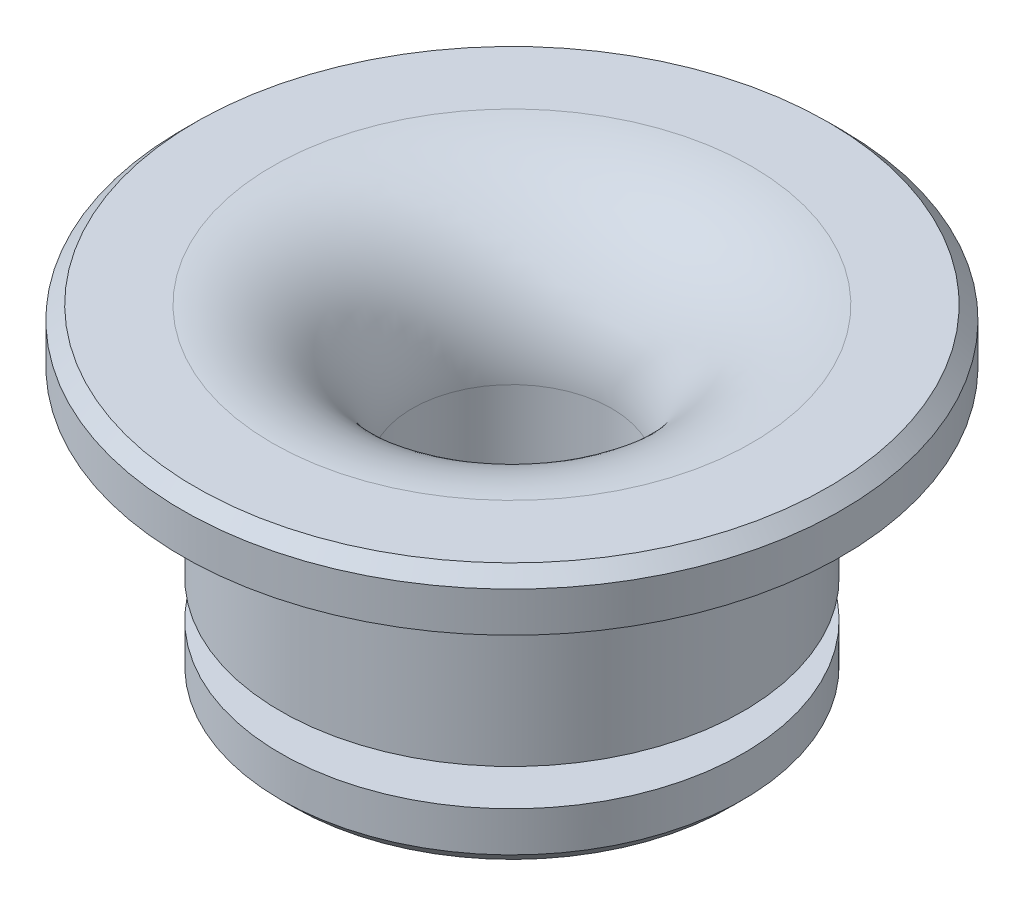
from build123d import *

# Parameters (mm, degrees)
CHAMFER_1_SIZE = 0.4
CHAMFER_2_SIZE = 0.4


with BuildPart() as part:
    # Sketch 2 → Revolve 1 (revolve)
    with BuildSketch(Plane.XY, mode=Mode.PRIVATE) as revolve_1_sk:
        with BuildLine():
            Line((-7.2, 0), (-9.9, 0))
            Line((-9.9, 0), (-9.9, -1.6))
            Line((-9.9, -1.6), (-6.95, -1.6))
            Line((-6.95, -1.6), (-6.95, -7.1))
            Line((-6.95, -7.1), (-5, -7.1))
            Line((-5, -7.1), (-5, -8.2))
            Line((-5, -8.2), (-6.95, -8.2))
            Line((-6.95, -8.2), (-6.95, -9.8))
            Line((-6.95, -9.8), (-3, -9.8))
            Line((-3, -9.8), (-3, -4.2))
            ThreePointArc((-3, -4.2), (-4.230151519, -1.230151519), (-7.2, 0))
        make_face()
    revolve(revolve_1_sk.sketch.rotate(Axis((0, -8, 0), (0, 1, 0)), 270), axis=Axis((0, -8, 0), (0, 1, 0)))

    # Chamfer 1
    chamfer_1_edges = [part.edges().sort_by_distance(p)[0] for p in [
        (0, -9.8, 6.95),
        (0, -9.8, 3),
    ]]
    chamfer(chamfer_1_edges, length=CHAMFER_1_SIZE)

    # Chamfer 2
    chamfer_2_edges = [part.edges().sort_by_distance(p)[0] for p in [
        (0, 0, 9.9),
    ]]
    chamfer(chamfer_2_edges, length=CHAMFER_2_SIZE)


solid = part.part
